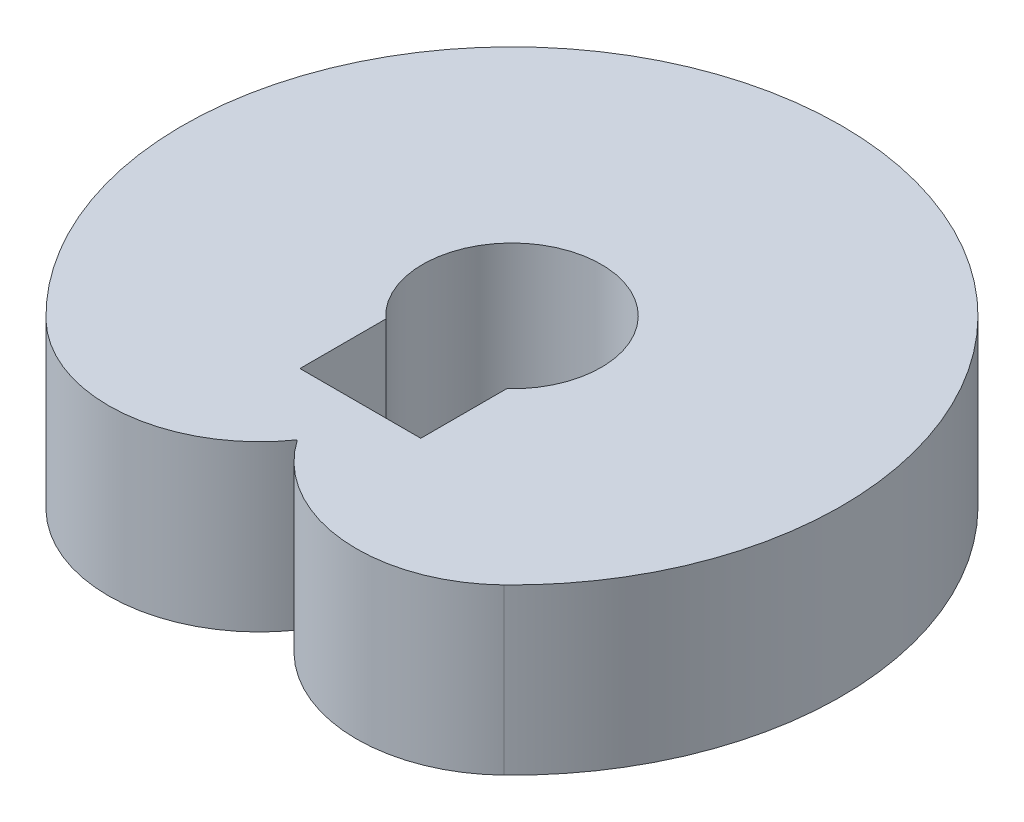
ISO-10303-21;
HEADER;
FILE_DESCRIPTION(('STEP AP214'),'2;1');
FILE_NAME('part.step','',(''),(''),'','','');
FILE_SCHEMA(('AUTOMOTIVE_DESIGN { 1 0 10303 214 1 1 1 1 }'));
ENDSEC;
DATA;
#1=APPLICATION_CONTEXT('core data for automotive mechanical design processes');
#2=APPLICATION_PROTOCOL_DEFINITION('international standard','automotive_design',2000,#1);
#3=PRODUCT_CONTEXT('',#1,'mechanical');
#4=PRODUCT('Part','Part','',(#3));
#5=PRODUCT_RELATED_PRODUCT_CATEGORY('part','',(#4));
#6=PRODUCT_DEFINITION_FORMATION('','',#4);
#7=PRODUCT_DEFINITION_CONTEXT('part definition',#1,'design');
#8=PRODUCT_DEFINITION('design','',#6,#7);
#9=PRODUCT_DEFINITION_SHAPE('','',#8);
#10=(LENGTH_UNIT() NAMED_UNIT(*) SI_UNIT(.MILLI.,.METRE.));
#11=(NAMED_UNIT(*) PLANE_ANGLE_UNIT() SI_UNIT($,.RADIAN.));
#12=(NAMED_UNIT(*) SI_UNIT($,.STERADIAN.) SOLID_ANGLE_UNIT());
#13=UNCERTAINTY_MEASURE_WITH_UNIT(LENGTH_MEASURE(1.E-05),#10,'distance_accuracy_value','');
#14=(GEOMETRIC_REPRESENTATION_CONTEXT(3) GLOBAL_UNCERTAINTY_ASSIGNED_CONTEXT((#13)) GLOBAL_UNIT_ASSIGNED_CONTEXT((#10,
#11,#12)) REPRESENTATION_CONTEXT('',''));
#15=CARTESIAN_POINT('',(0.,0.,0.));
#16=DIRECTION('',(0.,0.,1.));
#17=DIRECTION('',(1.,0.,0.));
#18=AXIS2_PLACEMENT_3D('',#15,#16,#17);
#19=CARTESIAN_POINT('',(225.763970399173,-300.,233.785435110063));
#20=DIRECTION('',(0.,1.,0.));
#21=DIRECTION('',(0.,0.,1.));
#22=AXIS2_PLACEMENT_3D('',#19,#20,#21);
#23=CYLINDRICAL_SURFACE('',#22,275.);
#24=CARTESIAN_POINT('',(225.763970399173,0.,233.785435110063));
#25=DIRECTION('',(0.,1.,0.));
#26=DIRECTION('',(0.,0.,1.));
#27=AXIS2_PLACEMENT_3D('',#24,#25,#26);
#28=CIRCLE('',#27,275.);
#29=CARTESIAN_POINT('',(3.33066907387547E-13,0.,390.806547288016));
#30=VERTEX_POINT('',#29);
#31=CARTESIAN_POINT('',(416.795022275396,0.,431.603880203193));
#32=VERTEX_POINT('',#31);
#33=EDGE_CURVE('E139',#30,#32,#28,.T.);
#34=ORIENTED_EDGE('',*,*,#33,.F.);
#35=DIRECTION('',(0.,1.,0.));
#36=VECTOR('',#35,1.);
#37=CARTESIAN_POINT('',(3.33066907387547E-13,-300.,390.806547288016));
#38=LINE('',#37,#36);
#39=CARTESIAN_POINT('',(3.33066907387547E-13,-300.,390.806547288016));
#40=VERTEX_POINT('',#39);
#41=EDGE_CURVE('E11',#40,#30,#38,.T.);
#42=ORIENTED_EDGE('',*,*,#41,.F.);
#43=CARTESIAN_POINT('',(225.763970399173,-300.,233.785435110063));
#44=DIRECTION('',(0.,1.,0.));
#45=DIRECTION('',(0.,0.,1.));
#46=AXIS2_PLACEMENT_3D('',#43,#44,#45);
#47=CIRCLE('',#46,275.);
#48=CARTESIAN_POINT('',(416.795022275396,-300.,431.603880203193));
#49=VERTEX_POINT('',#48);
#50=EDGE_CURVE('E142',#40,#49,#47,.T.);
#51=ORIENTED_EDGE('',*,*,#50,.T.);
#52=DIRECTION('',(0.,1.,0.));
#53=VECTOR('',#52,1.);
#54=CARTESIAN_POINT('',(416.795022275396,-300.,431.603880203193));
#55=LINE('',#54,#53);
#56=EDGE_CURVE('E37',#49,#32,#55,.T.);
#57=ORIENTED_EDGE('',*,*,#56,.T.);
#58=EDGE_LOOP('',(#34,#42,#51,#57));
#59=FACE_BOUND('',#58,.T.);
#60=ADVANCED_FACE('F34',(#59),#23,.T.);
#61=CARTESIAN_POINT('',(-225.763970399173,-300.,233.785435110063));
#62=DIRECTION('',(0.,1.,0.));
#63=DIRECTION('',(0.,0.,1.));
#64=AXIS2_PLACEMENT_3D('',#61,#62,#63);
#65=CYLINDRICAL_SURFACE('',#64,275.);
#66=CARTESIAN_POINT('',(-225.763970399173,0.,233.785435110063));
#67=DIRECTION('',(0.,1.,0.));
#68=DIRECTION('',(0.,0.,1.));
#69=AXIS2_PLACEMENT_3D('',#66,#67,#68);
#70=CIRCLE('',#69,275.);
#71=CARTESIAN_POINT('',(-416.795022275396,0.,431.603880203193));
#72=VERTEX_POINT('',#71);
#73=EDGE_CURVE('E145',#72,#30,#70,.T.);
#74=ORIENTED_EDGE('',*,*,#73,.F.);
#75=DIRECTION('',(0.,1.,0.));
#76=VECTOR('',#75,1.);
#77=CARTESIAN_POINT('',(-416.795022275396,-300.,431.603880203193));
#78=LINE('',#77,#76);
#79=CARTESIAN_POINT('',(-416.795022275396,-300.,431.603880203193));
#80=VERTEX_POINT('',#79);
#81=EDGE_CURVE('E42',#80,#72,#78,.T.);
#82=ORIENTED_EDGE('',*,*,#81,.F.);
#83=CARTESIAN_POINT('',(-225.763970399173,-300.,233.785435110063));
#84=DIRECTION('',(0.,1.,0.));
#85=DIRECTION('',(0.,0.,1.));
#86=AXIS2_PLACEMENT_3D('',#83,#84,#85);
#87=CIRCLE('',#86,275.);
#88=EDGE_CURVE('E147',#80,#40,#87,.T.);
#89=ORIENTED_EDGE('',*,*,#88,.T.);
#90=ORIENTED_EDGE('',*,*,#41,.T.);
#91=EDGE_LOOP('',(#74,#82,#89,#90));
#92=FACE_BOUND('',#91,.T.);
#93=ADVANCED_FACE('F158',(#92),#65,.T.);
#94=CARTESIAN_POINT('',(0.,-300.,0.));
#95=DIRECTION('',(0.,1.,0.));
#96=DIRECTION('',(0.,0.,1.));
#97=AXIS2_PLACEMENT_3D('',#94,#95,#96);
#98=CYLINDRICAL_SURFACE('',#97,600.);
#99=CARTESIAN_POINT('',(0.,0.,0.));
#100=DIRECTION('',(0.,1.,0.));
#101=DIRECTION('',(0.,0.,1.));
#102=AXIS2_PLACEMENT_3D('',#99,#100,#101);
#103=CIRCLE('',#102,600.);
#104=EDGE_CURVE('E151',#32,#72,#103,.T.);
#105=ORIENTED_EDGE('',*,*,#104,.F.);
#106=ORIENTED_EDGE('',*,*,#56,.F.);
#107=CARTESIAN_POINT('',(0.,-300.,0.));
#108=DIRECTION('',(0.,1.,0.));
#109=DIRECTION('',(0.,0.,1.));
#110=AXIS2_PLACEMENT_3D('',#107,#108,#109);
#111=CIRCLE('',#110,600.);
#112=EDGE_CURVE('E144',#49,#80,#111,.T.);
#113=ORIENTED_EDGE('',*,*,#112,.T.);
#114=ORIENTED_EDGE('',*,*,#81,.T.);
#115=EDGE_LOOP('',(#105,#106,#113,#114));
#116=FACE_BOUND('',#115,.T.);
#117=ADVANCED_FACE('F155',(#116),#98,.T.);
#118=CARTESIAN_POINT('',(112.881985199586,-300.,116.892717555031));
#119=DIRECTION('',(0.,1.,0.));
#120=DIRECTION('',(0.,0.,1.));
#121=AXIS2_PLACEMENT_3D('',#118,#119,#120);
#122=PLANE('',#121);
#123=CARTESIAN_POINT('',(0.,-300.,0.));
#124=DIRECTION('',(0.,1.,0.));
#125=DIRECTION('',(0.,0.,1.));
#126=AXIS2_PLACEMENT_3D('',#123,#124,#125);
#127=CIRCLE('',#126,162.628284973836);
#128=CARTESIAN_POINT('',(110.,-300.,119.782966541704));
#129=VERTEX_POINT('',#128);
#130=CARTESIAN_POINT('',(-110.,-300.,119.782966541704));
#131=VERTEX_POINT('',#130);
#132=EDGE_CURVE('E124',#129,#131,#127,.T.);
#133=ORIENTED_EDGE('',*,*,#132,.T.);
#134=DIRECTION('',(0.,0.,1.));
#135=VECTOR('',#134,1.);
#136=CARTESIAN_POINT('',(-110.,-300.,119.782966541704));
#137=LINE('',#136,#135);
#138=CARTESIAN_POINT('',(-110.,-300.,276.));
#139=VERTEX_POINT('',#138);
#140=EDGE_CURVE('E103',#131,#139,#137,.T.);
#141=ORIENTED_EDGE('',*,*,#140,.T.);
#142=DIRECTION('',(1.,0.,0.));
#143=VECTOR('',#142,1.);
#144=CARTESIAN_POINT('',(-110.,-300.,276.));
#145=LINE('',#144,#143);
#146=CARTESIAN_POINT('',(110.,-300.,276.));
#147=VERTEX_POINT('',#146);
#148=EDGE_CURVE('E114',#139,#147,#145,.T.);
#149=ORIENTED_EDGE('',*,*,#148,.T.);
#150=DIRECTION('',(0.,0.,-1.));
#151=VECTOR('',#150,1.);
#152=CARTESIAN_POINT('',(110.,-300.,119.782966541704));
#153=LINE('',#152,#151);
#154=EDGE_CURVE('E111',#147,#129,#153,.T.);
#155=ORIENTED_EDGE('',*,*,#154,.T.);
#156=EDGE_LOOP('',(#133,#141,#149,#155));
#157=FACE_BOUND('',#156,.T.);
#158=ORIENTED_EDGE('',*,*,#50,.F.);
#159=ORIENTED_EDGE('',*,*,#88,.F.);
#160=ORIENTED_EDGE('',*,*,#112,.F.);
#161=EDGE_LOOP('',(#158,#159,#160));
#162=FACE_BOUND('',#161,.T.);
#163=ADVANCED_FACE('F121',(#157,#162),#122,.F.);
#164=CARTESIAN_POINT('',(112.881985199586,0.,116.892717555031));
#165=DIRECTION('',(0.,1.,0.));
#166=DIRECTION('',(0.,0.,1.));
#167=AXIS2_PLACEMENT_3D('',#164,#165,#166);
#168=PLANE('',#167);
#169=DIRECTION('',(0.,0.,1.));
#170=VECTOR('',#169,1.);
#171=CARTESIAN_POINT('',(-110.,0.,119.782966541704));
#172=LINE('',#171,#170);
#173=CARTESIAN_POINT('',(-110.,0.,119.782966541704));
#174=VERTEX_POINT('',#173);
#175=CARTESIAN_POINT('',(-110.,0.,276.));
#176=VERTEX_POINT('',#175);
#177=EDGE_CURVE('E106',#174,#176,#172,.T.);
#178=ORIENTED_EDGE('',*,*,#177,.F.);
#179=CARTESIAN_POINT('',(0.,0.,0.));
#180=DIRECTION('',(0.,1.,0.));
#181=DIRECTION('',(0.,0.,1.));
#182=AXIS2_PLACEMENT_3D('',#179,#180,#181);
#183=CIRCLE('',#182,162.628284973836);
#184=CARTESIAN_POINT('',(110.,0.,119.782966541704));
#185=VERTEX_POINT('',#184);
#186=EDGE_CURVE('E134',#185,#174,#183,.T.);
#187=ORIENTED_EDGE('',*,*,#186,.F.);
#188=DIRECTION('',(0.,0.,-1.));
#189=VECTOR('',#188,1.);
#190=CARTESIAN_POINT('',(110.,0.,119.782966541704));
#191=LINE('',#190,#189);
#192=CARTESIAN_POINT('',(110.,0.,276.));
#193=VERTEX_POINT('',#192);
#194=EDGE_CURVE('E50',#193,#185,#191,.T.);
#195=ORIENTED_EDGE('',*,*,#194,.F.);
#196=DIRECTION('',(1.,0.,0.));
#197=VECTOR('',#196,1.);
#198=CARTESIAN_POINT('',(-110.,0.,276.));
#199=LINE('',#198,#197);
#200=EDGE_CURVE('E126',#176,#193,#199,.T.);
#201=ORIENTED_EDGE('',*,*,#200,.F.);
#202=EDGE_LOOP('',(#178,#187,#195,#201));
#203=FACE_BOUND('',#202,.T.);
#204=ORIENTED_EDGE('',*,*,#33,.T.);
#205=ORIENTED_EDGE('',*,*,#104,.T.);
#206=ORIENTED_EDGE('',*,*,#73,.T.);
#207=EDGE_LOOP('',(#204,#205,#206));
#208=FACE_BOUND('',#207,.T.);
#209=ADVANCED_FACE('F157',(#203,#208),#168,.T.);
#210=CARTESIAN_POINT('',(0.,-300.,0.));
#211=DIRECTION('',(0.,1.,0.));
#212=DIRECTION('',(0.,0.,1.));
#213=AXIS2_PLACEMENT_3D('',#210,#211,#212);
#214=CYLINDRICAL_SURFACE('',#213,162.628284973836);
#215=ORIENTED_EDGE('',*,*,#186,.T.);
#216=DIRECTION('',(0.,1.,0.));
#217=VECTOR('',#216,1.);
#218=CARTESIAN_POINT('',(-110.,-300.,119.782966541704));
#219=LINE('',#218,#217);
#220=EDGE_CURVE('E132',#131,#174,#219,.T.);
#221=ORIENTED_EDGE('',*,*,#220,.F.);
#222=ORIENTED_EDGE('',*,*,#132,.F.);
#223=DIRECTION('',(0.,1.,0.));
#224=VECTOR('',#223,1.);
#225=CARTESIAN_POINT('',(110.,-300.,119.782966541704));
#226=LINE('',#225,#224);
#227=EDGE_CURVE('E135',#129,#185,#226,.T.);
#228=ORIENTED_EDGE('',*,*,#227,.T.);
#229=EDGE_LOOP('',(#215,#221,#222,#228));
#230=FACE_BOUND('',#229,.T.);
#231=ADVANCED_FACE('F166',(#230),#214,.F.);
#232=CARTESIAN_POINT('',(-110.,-300.,119.782966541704));
#233=DIRECTION('',(-1.,0.,0.));
#234=DIRECTION('',(0.,0.,1.));
#235=AXIS2_PLACEMENT_3D('',#232,#233,#234);
#236=PLANE('',#235);
#237=ORIENTED_EDGE('',*,*,#177,.T.);
#238=DIRECTION('',(0.,1.,0.));
#239=VECTOR('',#238,1.);
#240=CARTESIAN_POINT('',(-110.,-300.,276.));
#241=LINE('',#240,#239);
#242=EDGE_CURVE('E99',#139,#176,#241,.T.);
#243=ORIENTED_EDGE('',*,*,#242,.F.);
#244=ORIENTED_EDGE('',*,*,#140,.F.);
#245=ORIENTED_EDGE('',*,*,#220,.T.);
#246=EDGE_LOOP('',(#237,#243,#244,#245));
#247=FACE_BOUND('',#246,.T.);
#248=ADVANCED_FACE('F101',(#247),#236,.F.);
#249=CARTESIAN_POINT('',(110.,-300.,119.782966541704));
#250=DIRECTION('',(1.,0.,0.));
#251=DIRECTION('',(0.,0.,-1.));
#252=AXIS2_PLACEMENT_3D('',#249,#250,#251);
#253=PLANE('',#252);
#254=ORIENTED_EDGE('',*,*,#194,.T.);
#255=ORIENTED_EDGE('',*,*,#227,.F.);
#256=ORIENTED_EDGE('',*,*,#154,.F.);
#257=DIRECTION('',(0.,1.,0.));
#258=VECTOR('',#257,1.);
#259=CARTESIAN_POINT('',(110.,-300.,276.));
#260=LINE('',#259,#258);
#261=EDGE_CURVE('E110',#147,#193,#260,.T.);
#262=ORIENTED_EDGE('',*,*,#261,.T.);
#263=EDGE_LOOP('',(#254,#255,#256,#262));
#264=FACE_BOUND('',#263,.T.);
#265=ADVANCED_FACE('F208',(#264),#253,.F.);
#266=CARTESIAN_POINT('',(-110.,-300.,276.));
#267=DIRECTION('',(0.,0.,1.));
#268=DIRECTION('',(1.,0.,0.));
#269=AXIS2_PLACEMENT_3D('',#266,#267,#268);
#270=PLANE('',#269);
#271=ORIENTED_EDGE('',*,*,#200,.T.);
#272=ORIENTED_EDGE('',*,*,#261,.F.);
#273=ORIENTED_EDGE('',*,*,#148,.F.);
#274=ORIENTED_EDGE('',*,*,#242,.T.);
#275=EDGE_LOOP('',(#271,#272,#273,#274));
#276=FACE_BOUND('',#275,.T.);
#277=ADVANCED_FACE('F115',(#276),#270,.F.);
#278=CLOSED_SHELL('',(#60,#93,#117,#163,#209,#231,#248,#265,#277));
#279=MANIFOLD_SOLID_BREP('B2',#278);
#280=ADVANCED_BREP_SHAPE_REPRESENTATION('',(#18,#279),#14);
#281=SHAPE_DEFINITION_REPRESENTATION(#9,#280);
ENDSEC;
END-ISO-10303-21;
